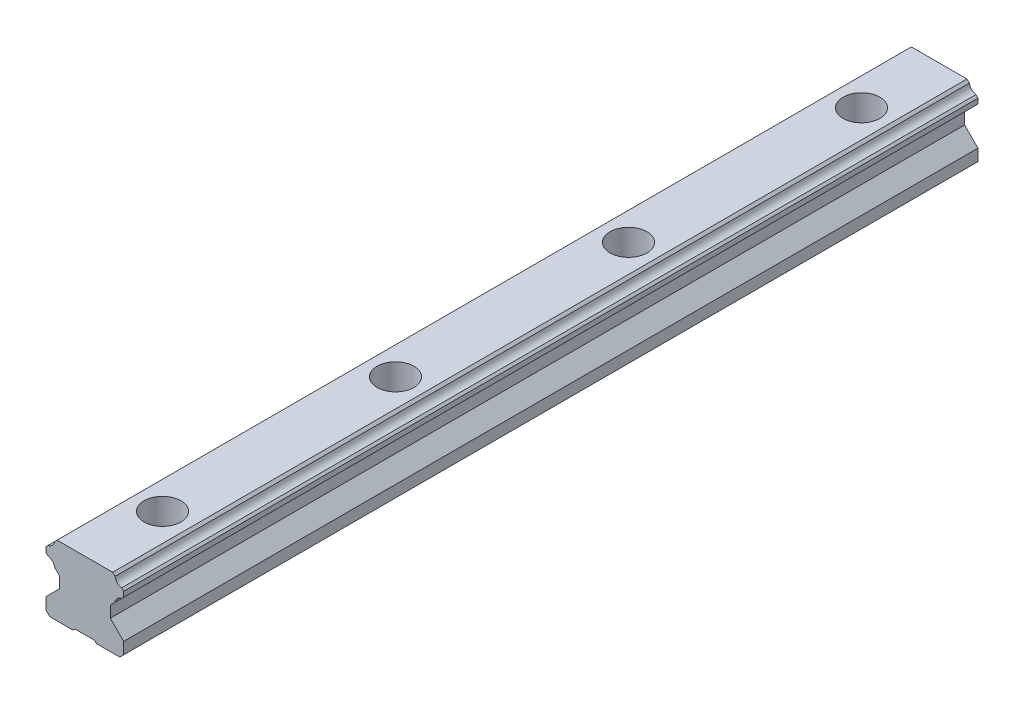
from build123d import *

# Parameters (mm, degrees)
BOSS_EXTRUDE1_DEPTH                                 = 110
CBORE_FOR_M4_HEX_SOCKET_HEAD_CAP_SCREW1_D           = 6
CBORE_FOR_M4_HEX_SOCKET_HEAD_CAP_SCREW1_CBORE_D     = 9.5
CBORE_FOR_M4_HEX_SOCKET_HEAD_CAP_SCREW1_CBORE_DEPTH = 8.5
LPATTERN1_COUNT                                     = 4
LPATTERN1_PITCH                                     = 60


with BuildPart() as part:
    # Sketch1 → Boss-Extrude1 (new, symmetric)
    with BuildSketch(Plane.XY):
        with BuildLine():
            Line((-6.550048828, 10.379235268), (-7.765945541, 11.595131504))
            ThreePointArc((-7.765945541, 11.595131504), (-8.344873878, 12.735447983), (-9.485190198, 13.314376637))
            Line((-9.485190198, 13.314376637), (-10, 13.82918644))
            Line((-10, 13.82918644), (-10, 15.160037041))
            Line((-10, 15.160037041), (-9.472673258, 15.687363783))
            ThreePointArc((-9.472673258, 15.687363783), (-8.344874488, 16.264307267), (-7.767930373, 17.392105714))
            Line((-7.767930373, 17.392105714), (-7.160036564, 18))
            Line((-7.160036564, 18), (7.160036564, 18))
            Line((7.160036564, 18), (7.767930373, 17.392105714))
            ThreePointArc((7.767930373, 17.392105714), (8.344874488, 16.264307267), (9.472673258, 15.687363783))
            Line((9.472673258, 15.687363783), (10, 15.160037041))
            Line((10, 15.160037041), (10, 13.82918644))
            Line((10, 13.82918644), (9.485190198, 13.314376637))
            ThreePointArc((9.485190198, 13.314376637), (8.344873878, 12.735447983), (7.765945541, 11.595131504))
            Line((7.765945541, 11.595131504), (6.550048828, 10.379235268))
            Line((6.550048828, 10.379235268), (6.550048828, 7.449951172))
            Line((6.550048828, 7.449951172), (10, 4.000077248))
            Line((10, 4.000077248), (10, 1))
            Line((10, 1), (9, 0))
            Line((9, 0), (3, 0))
            Line((3, 0), (2.5, 0.5))
            Line((2.5, 0.5), (-2.5, 0.5))
            Line((-2.5, 0.5), (-3, 0))
            Line((-3, 0), (-9, 0))
            Line((-9, 0), (-10, 1))
            Line((-10, 1), (-10, 4.000077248))
            Line((-10, 4.000077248), (-6.550048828, 7.449951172))
            Line((-6.550048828, 7.449951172), (-6.550048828, 10.379235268))
        make_face()
    extrude(amount=BOSS_EXTRUDE1_DEPTH, both=True)

    # CBORE for M4 Hex Socket Head Cap Screw1 (through all)
    with Locations(Plane(origin=(0, 18, 0), x_dir=(1, 0, 0), z_dir=(0, 1, 0))):
        with Locations((0, -90)):
            cbore_for_m4_hex_socket_head_cap_screw1 = CounterBoreHole(CBORE_FOR_M4_HEX_SOCKET_HEAD_CAP_SCREW1_D / 2, CBORE_FOR_M4_HEX_SOCKET_HEAD_CAP_SCREW1_CBORE_D / 2, CBORE_FOR_M4_HEX_SOCKET_HEAD_CAP_SCREW1_CBORE_DEPTH)

    # LPattern1: CBORE for M4 Hex Socket Head Cap Screw1 ×4
    with Locations(*[(0, 0, -i * LPATTERN1_PITCH) for i in range(1, LPATTERN1_COUNT)]):
        add(cbore_for_m4_hex_socket_head_cap_screw1, mode=Mode.SUBTRACT)


solid = part.part
